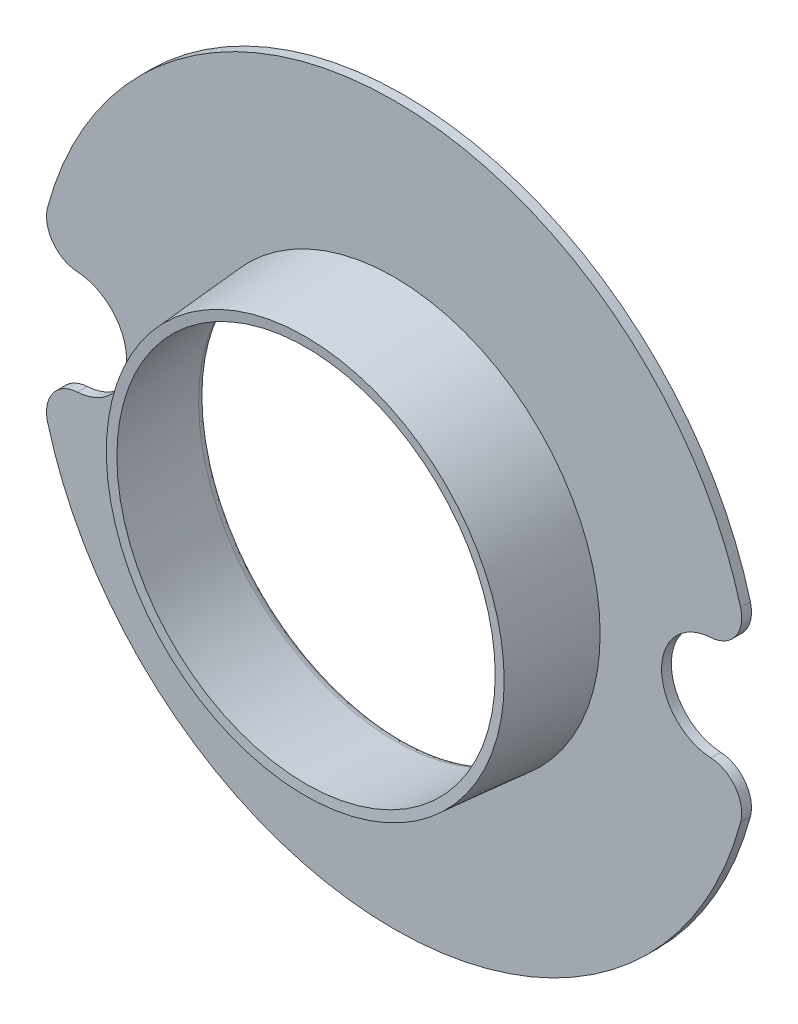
ISO-10303-21;
HEADER;
FILE_DESCRIPTION(('STEP AP214'),'2;1');
FILE_NAME('part.step','',(''),(''),'','','');
FILE_SCHEMA(('AUTOMOTIVE_DESIGN { 1 0 10303 214 1 1 1 1 }'));
ENDSEC;
DATA;
#1=APPLICATION_CONTEXT('core data for automotive mechanical design processes');
#2=APPLICATION_PROTOCOL_DEFINITION('international standard','automotive_design',2000,#1);
#3=PRODUCT_CONTEXT('',#1,'mechanical');
#4=PRODUCT('Part','Part','',(#3));
#5=PRODUCT_RELATED_PRODUCT_CATEGORY('part','',(#4));
#6=PRODUCT_DEFINITION_FORMATION('','',#4);
#7=PRODUCT_DEFINITION_CONTEXT('part definition',#1,'design');
#8=PRODUCT_DEFINITION('design','',#6,#7);
#9=PRODUCT_DEFINITION_SHAPE('','',#8);
#10=(LENGTH_UNIT() NAMED_UNIT(*) SI_UNIT(.MILLI.,.METRE.));
#11=(NAMED_UNIT(*) PLANE_ANGLE_UNIT() SI_UNIT($,.RADIAN.));
#12=(NAMED_UNIT(*) SI_UNIT($,.STERADIAN.) SOLID_ANGLE_UNIT());
#13=UNCERTAINTY_MEASURE_WITH_UNIT(LENGTH_MEASURE(1.E-05),#10,'distance_accuracy_value','');
#14=(GEOMETRIC_REPRESENTATION_CONTEXT(3) GLOBAL_UNCERTAINTY_ASSIGNED_CONTEXT((#13)) GLOBAL_UNIT_ASSIGNED_CONTEXT((#10,
#11,#12)) REPRESENTATION_CONTEXT('',''));
#15=CARTESIAN_POINT('',(0.,0.,0.));
#16=DIRECTION('',(0.,0.,1.));
#17=DIRECTION('',(1.,0.,0.));
#18=AXIS2_PLACEMENT_3D('',#15,#16,#17);
#19=CARTESIAN_POINT('',(0.,0.,22.51196178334));
#20=DIRECTION('',(0.,0.,-1.));
#21=DIRECTION('',(0.,1.,0.));
#22=AXIS2_PLACEMENT_3D('',#19,#20,#21);
#23=CONICAL_SURFACE('',#22,3.04952229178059,0.0798299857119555);
#24=CARTESIAN_POINT('',(0.,0.,22.5119617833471));
#25=DIRECTION('',(0.,0.,-1.));
#26=DIRECTION('',(1.,0.,0.));
#27=AXIS2_PLACEMENT_3D('',#24,#25,#26);
#28=CIRCLE('',#27,3.04952229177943);
#29=CARTESIAN_POINT('',(3.04952229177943,0.,22.5119617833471));
#30=VERTEX_POINT('',#29);
#31=EDGE_CURVE('E96',#30,#30,#28,.T.);
#32=ORIENTED_EDGE('',*,*,#31,.T.);
#33=EDGE_LOOP('',(#32));
#34=FACE_BOUND('',#33,.T.);
#35=CARTESIAN_POINT('',(0.,0.,21.15));
#36=DIRECTION('',(0.,0.,-1.));
#37=DIRECTION('',(0.,1.,0.));
#38=AXIS2_PLACEMENT_3D('',#35,#36,#37);
#39=CIRCLE('',#38,3.15847923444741);
#40=CARTESIAN_POINT('',(0.,3.15847923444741,21.15));
#41=VERTEX_POINT('',#40);
#42=EDGE_CURVE('E95',#41,#41,#39,.F.);
#43=ORIENTED_EDGE('',*,*,#42,.T.);
#44=EDGE_LOOP('',(#43));
#45=FACE_BOUND('',#44,.T.);
#46=ADVANCED_FACE('F16',(#34,#45),#23,.T.);
#47=CARTESIAN_POINT('',(0.,0.,22.5119617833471));
#48=DIRECTION('',(0.,0.,1.));
#49=DIRECTION('',(1.,0.,0.));
#50=AXIS2_PLACEMENT_3D('',#47,#48,#49);
#51=CONICAL_SURFACE('',#50,3.04952229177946,1.49096634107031);
#52=CARTESIAN_POINT('',(0.,0.,22.5));
#53=DIRECTION('',(0.,0.,-1.));
#54=DIRECTION('',(1.,0.,0.));
#55=AXIS2_PLACEMENT_3D('',#52,#53,#54);
#56=CIRCLE('',#55,2.89999999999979);
#57=CARTESIAN_POINT('',(2.89999999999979,0.,22.5));
#58=VERTEX_POINT('',#57);
#59=EDGE_CURVE('E139',#58,#58,#56,.T.);
#60=ORIENTED_EDGE('',*,*,#59,.T.);
#61=EDGE_LOOP('',(#60));
#62=FACE_BOUND('',#61,.T.);
#63=ORIENTED_EDGE('',*,*,#31,.F.);
#64=EDGE_LOOP('',(#63));
#65=FACE_BOUND('',#64,.T.);
#66=ADVANCED_FACE('F190',(#62,#65),#51,.F.);
#67=CARTESIAN_POINT('',(-5.541827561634,5.72,21.15));
#68=DIRECTION('',(0.,0.,-1.));
#69=DIRECTION('',(1.,0.,0.));
#70=AXIS2_PLACEMENT_3D('',#67,#68,#69);
#71=PLANE('',#70);
#72=ORIENTED_EDGE('',*,*,#42,.F.);
#73=EDGE_LOOP('',(#72));
#74=FACE_BOUND('',#73,.T.);
#75=CARTESIAN_POINT('',(4.9,0.,21.15));
#76=DIRECTION('',(0.,0.,1.));
#77=DIRECTION('',(1.,0.,0.));
#78=AXIS2_PLACEMENT_3D('',#75,#76,#77);
#79=CIRCLE('',#78,0.799999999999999);
#80=CARTESIAN_POINT('',(4.85604395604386,-0.798791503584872,21.15));
#81=VERTEX_POINT('',#80);
#82=CARTESIAN_POINT('',(4.85604395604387,0.798791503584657,21.15));
#83=VERTEX_POINT('',#82);
#84=EDGE_CURVE('E99',#81,#83,#79,.F.);
#85=ORIENTED_EDGE('',*,*,#84,.T.);
#86=CARTESIAN_POINT('',(4.828571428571,1.298036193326,21.15));
#87=DIRECTION('',(0.,0.,-1.));
#88=DIRECTION('',(-1.,0.,0.));
#89=AXIS2_PLACEMENT_3D('',#86,#87,#88);
#90=CIRCLE('',#89,0.500000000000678);
#91=CARTESIAN_POINT('',(5.31142857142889,1.42783981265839,21.15));
#92=VERTEX_POINT('',#91);
#93=EDGE_CURVE('E84',#92,#83,#90,.T.);
#94=ORIENTED_EDGE('',*,*,#93,.F.);
#95=CARTESIAN_POINT('',(0.,0.,21.15));
#96=DIRECTION('',(0.,0.,-1.));
#97=DIRECTION('',(-1.,0.,0.));
#98=AXIS2_PLACEMENT_3D('',#95,#96,#97);
#99=CIRCLE('',#98,5.5);
#100=CARTESIAN_POINT('',(-5.31142857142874,1.42783981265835,21.15));
#101=VERTEX_POINT('',#100);
#102=EDGE_CURVE('E142',#92,#101,#99,.F.);
#103=ORIENTED_EDGE('',*,*,#102,.T.);
#104=CARTESIAN_POINT('',(-4.828571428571,1.298036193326,21.15));
#105=DIRECTION('',(0.,0.,1.));
#106=DIRECTION('',(1.,0.,0.));
#107=AXIS2_PLACEMENT_3D('',#104,#105,#106);
#108=CIRCLE('',#107,0.500000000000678);
#109=CARTESIAN_POINT('',(-4.85604395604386,0.798791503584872,21.15));
#110=VERTEX_POINT('',#109);
#111=EDGE_CURVE('E135',#101,#110,#108,.T.);
#112=ORIENTED_EDGE('',*,*,#111,.T.);
#113=CARTESIAN_POINT('',(-4.9,0.,21.15));
#114=DIRECTION('',(0.,0.,-1.));
#115=DIRECTION('',(-1.,0.,0.));
#116=AXIS2_PLACEMENT_3D('',#113,#114,#115);
#117=CIRCLE('',#116,0.799999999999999);
#118=CARTESIAN_POINT('',(-4.85604395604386,-0.798791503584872,21.15));
#119=VERTEX_POINT('',#118);
#120=EDGE_CURVE('E128',#110,#119,#117,.T.);
#121=ORIENTED_EDGE('',*,*,#120,.T.);
#122=CARTESIAN_POINT('',(-4.828571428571,-1.298036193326,21.15));
#123=DIRECTION('',(0.,0.,-1.));
#124=DIRECTION('',(-1.,0.,0.));
#125=AXIS2_PLACEMENT_3D('',#122,#123,#124);
#126=CIRCLE('',#125,0.500000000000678);
#127=CARTESIAN_POINT('',(-5.31142857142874,-1.42783981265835,21.15));
#128=VERTEX_POINT('',#127);
#129=EDGE_CURVE('E127',#119,#128,#126,.F.);
#130=ORIENTED_EDGE('',*,*,#129,.T.);
#131=CARTESIAN_POINT('',(0.,0.,21.15));
#132=DIRECTION('',(0.,0.,-1.));
#133=DIRECTION('',(-1.,0.,0.));
#134=AXIS2_PLACEMENT_3D('',#131,#132,#133);
#135=CIRCLE('',#134,5.5);
#136=CARTESIAN_POINT('',(5.31142857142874,-1.42783981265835,21.15));
#137=VERTEX_POINT('',#136);
#138=EDGE_CURVE('E123',#128,#137,#135,.F.);
#139=ORIENTED_EDGE('',*,*,#138,.T.);
#140=CARTESIAN_POINT('',(4.828571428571,-1.298036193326,21.15));
#141=DIRECTION('',(0.,0.,1.));
#142=DIRECTION('',(1.,0.,0.));
#143=AXIS2_PLACEMENT_3D('',#140,#141,#142);
#144=CIRCLE('',#143,0.500000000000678);
#145=EDGE_CURVE('E102',#137,#81,#144,.T.);
#146=ORIENTED_EDGE('',*,*,#145,.T.);
#147=EDGE_LOOP('',(#85,#94,#103,#112,#121,#130,#139,#146));
#148=FACE_BOUND('',#147,.T.);
#149=ADVANCED_FACE('F100',(#74,#148),#71,.F.);
#150=CARTESIAN_POINT('',(0.,0.,22.5));
#151=DIRECTION('',(0.,0.,-1.));
#152=DIRECTION('',(-1.,0.,0.));
#153=AXIS2_PLACEMENT_3D('',#150,#151,#152);
#154=CONICAL_SURFACE('',#153,2.89999999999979,0.0798299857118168);
#155=ORIENTED_EDGE('',*,*,#59,.F.);
#156=EDGE_LOOP('',(#155));
#157=FACE_BOUND('',#156,.T.);
#158=CARTESIAN_POINT('',(0.,0.,21.13803822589));
#159=DIRECTION('',(0.,0.,-1.));
#160=DIRECTION('',(-0.999963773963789,-0.00851180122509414,0.));
#161=AXIS2_PLACEMENT_3D('',#158,#159,#160);
#162=CIRCLE('',#161,3.0089569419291);
#163=CARTESIAN_POINT('',(-3.00884793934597,-0.0256116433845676,21.13803822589));
#164=VERTEX_POINT('',#163);
#165=EDGE_CURVE('E112',#164,#164,#162,.T.);
#166=ORIENTED_EDGE('',*,*,#165,.T.);
#167=EDGE_LOOP('',(#166));
#168=FACE_BOUND('',#167,.T.);
#169=ADVANCED_FACE('F189',(#157,#168),#154,.F.);
#170=CARTESIAN_POINT('',(0.,0.,21.15));
#171=DIRECTION('',(0.,0.,-1.));
#172=DIRECTION('',(-1.,0.,0.));
#173=AXIS2_PLACEMENT_3D('',#170,#171,#172);
#174=CYLINDRICAL_SURFACE('',#173,5.5);
#175=CARTESIAN_POINT('',(0.,0.,21.));
#176=DIRECTION('',(0.,0.,-1.));
#177=DIRECTION('',(-1.,0.,0.));
#178=AXIS2_PLACEMENT_3D('',#175,#176,#177);
#179=CIRCLE('',#178,5.5);
#180=CARTESIAN_POINT('',(5.31142857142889,1.42783981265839,21.));
#181=VERTEX_POINT('',#180);
#182=CARTESIAN_POINT('',(-5.31142857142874,1.42783981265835,21.));
#183=VERTEX_POINT('',#182);
#184=EDGE_CURVE('E138',#181,#183,#179,.F.);
#185=ORIENTED_EDGE('',*,*,#184,.T.);
#186=DIRECTION('',(0.,0.,1.));
#187=VECTOR('',#186,1.);
#188=CARTESIAN_POINT('',(-5.311428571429,1.427839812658,21.075));
#189=LINE('',#188,#187);
#190=EDGE_CURVE('E132',#183,#101,#189,.T.);
#191=ORIENTED_EDGE('',*,*,#190,.T.);
#192=ORIENTED_EDGE('',*,*,#102,.F.);
#193=DIRECTION('',(0.,0.,-1.));
#194=VECTOR('',#193,1.);
#195=CARTESIAN_POINT('',(5.311428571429,1.427839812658,21.075));
#196=LINE('',#195,#194);
#197=EDGE_CURVE('E94',#92,#181,#196,.T.);
#198=ORIENTED_EDGE('',*,*,#197,.T.);
#199=EDGE_LOOP('',(#185,#191,#192,#198));
#200=FACE_BOUND('',#199,.T.);
#201=ADVANCED_FACE('F196',(#200),#174,.T.);
#202=CARTESIAN_POINT('',(-4.828571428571,1.298036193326,21.));
#203=DIRECTION('',(0.,0.,1.));
#204=DIRECTION('',(1.,0.,0.));
#205=AXIS2_PLACEMENT_3D('',#202,#203,#204);
#206=CYLINDRICAL_SURFACE('',#205,0.500000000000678);
#207=CARTESIAN_POINT('',(-4.828571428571,1.298036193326,21.));
#208=DIRECTION('',(0.,0.,1.));
#209=DIRECTION('',(1.,0.,0.));
#210=AXIS2_PLACEMENT_3D('',#207,#208,#209);
#211=CIRCLE('',#210,0.500000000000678);
#212=CARTESIAN_POINT('',(-4.85604395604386,0.798791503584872,21.));
#213=VERTEX_POINT('',#212);
#214=EDGE_CURVE('E175',#183,#213,#211,.T.);
#215=ORIENTED_EDGE('',*,*,#214,.T.);
#216=DIRECTION('',(0.,0.,-1.));
#217=VECTOR('',#216,1.);
#218=CARTESIAN_POINT('',(-4.856043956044,0.798791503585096,21.075));
#219=LINE('',#218,#217);
#220=EDGE_CURVE('E129',#213,#110,#219,.F.);
#221=ORIENTED_EDGE('',*,*,#220,.T.);
#222=ORIENTED_EDGE('',*,*,#111,.F.);
#223=ORIENTED_EDGE('',*,*,#190,.F.);
#224=EDGE_LOOP('',(#215,#221,#222,#223));
#225=FACE_BOUND('',#224,.T.);
#226=ADVANCED_FACE('F217',(#225),#206,.T.);
#227=CARTESIAN_POINT('',(-4.9,0.,21.15));
#228=DIRECTION('',(0.,0.,-1.));
#229=DIRECTION('',(-1.,0.,0.));
#230=AXIS2_PLACEMENT_3D('',#227,#228,#229);
#231=CYLINDRICAL_SURFACE('',#230,0.799999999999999);
#232=DIRECTION('',(0.,0.,1.));
#233=VECTOR('',#232,1.);
#234=CARTESIAN_POINT('',(-4.85604395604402,-0.798791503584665,21.075));
#235=LINE('',#234,#233);
#236=CARTESIAN_POINT('',(-4.85604395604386,-0.798791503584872,21.));
#237=VERTEX_POINT('',#236);
#238=EDGE_CURVE('E124',#237,#119,#235,.T.);
#239=ORIENTED_EDGE('',*,*,#238,.T.);
#240=ORIENTED_EDGE('',*,*,#120,.F.);
#241=ORIENTED_EDGE('',*,*,#220,.F.);
#242=CARTESIAN_POINT('',(-4.9,0.,21.));
#243=DIRECTION('',(0.,0.,-1.));
#244=DIRECTION('',(-1.,0.,0.));
#245=AXIS2_PLACEMENT_3D('',#242,#243,#244);
#246=CIRCLE('',#245,0.799999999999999);
#247=EDGE_CURVE('E173',#213,#237,#246,.T.);
#248=ORIENTED_EDGE('',*,*,#247,.T.);
#249=EDGE_LOOP('',(#239,#240,#241,#248));
#250=FACE_BOUND('',#249,.T.);
#251=ADVANCED_FACE('F223',(#250),#231,.F.);
#252=CARTESIAN_POINT('',(-4.828571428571,-1.298036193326,21.15));
#253=DIRECTION('',(0.,0.,-1.));
#254=DIRECTION('',(-1.,0.,0.));
#255=AXIS2_PLACEMENT_3D('',#252,#253,#254);
#256=CYLINDRICAL_SURFACE('',#255,0.500000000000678);
#257=ORIENTED_EDGE('',*,*,#129,.F.);
#258=ORIENTED_EDGE('',*,*,#238,.F.);
#259=CARTESIAN_POINT('',(-4.828571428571,-1.298036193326,21.));
#260=DIRECTION('',(0.,0.,-1.));
#261=DIRECTION('',(-1.,0.,0.));
#262=AXIS2_PLACEMENT_3D('',#259,#260,#261);
#263=CIRCLE('',#262,0.500000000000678);
#264=CARTESIAN_POINT('',(-5.31142857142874,-1.42783981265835,21.));
#265=VERTEX_POINT('',#264);
#266=EDGE_CURVE('E171',#237,#265,#263,.F.);
#267=ORIENTED_EDGE('',*,*,#266,.T.);
#268=DIRECTION('',(0.,0.,1.));
#269=VECTOR('',#268,1.);
#270=CARTESIAN_POINT('',(-5.31142857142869,-1.42783981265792,21.075));
#271=LINE('',#270,#269);
#272=EDGE_CURVE('E120',#265,#128,#271,.T.);
#273=ORIENTED_EDGE('',*,*,#272,.T.);
#274=EDGE_LOOP('',(#257,#258,#267,#273));
#275=FACE_BOUND('',#274,.T.);
#276=ADVANCED_FACE('F226',(#275),#256,.T.);
#277=CARTESIAN_POINT('',(0.,0.,21.15));
#278=DIRECTION('',(0.,0.,-1.));
#279=DIRECTION('',(-1.,0.,0.));
#280=AXIS2_PLACEMENT_3D('',#277,#278,#279);
#281=CYLINDRICAL_SURFACE('',#280,5.5);
#282=CARTESIAN_POINT('',(0.,0.,21.));
#283=DIRECTION('',(0.,0.,-1.));
#284=DIRECTION('',(-1.,0.,0.));
#285=AXIS2_PLACEMENT_3D('',#282,#283,#284);
#286=CIRCLE('',#285,5.5);
#287=CARTESIAN_POINT('',(5.31142857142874,-1.42783981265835,21.));
#288=VERTEX_POINT('',#287);
#289=EDGE_CURVE('E169',#265,#288,#286,.F.);
#290=ORIENTED_EDGE('',*,*,#289,.T.);
#291=DIRECTION('',(0.,0.,1.));
#292=VECTOR('',#291,1.);
#293=CARTESIAN_POINT('',(5.311428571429,-1.427839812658,21.075));
#294=LINE('',#293,#292);
#295=EDGE_CURVE('E117',#288,#137,#294,.T.);
#296=ORIENTED_EDGE('',*,*,#295,.T.);
#297=ORIENTED_EDGE('',*,*,#138,.F.);
#298=ORIENTED_EDGE('',*,*,#272,.F.);
#299=EDGE_LOOP('',(#290,#296,#297,#298));
#300=FACE_BOUND('',#299,.T.);
#301=ADVANCED_FACE('F230',(#300),#281,.T.);
#302=CARTESIAN_POINT('',(4.828571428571,-1.298036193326,21.));
#303=DIRECTION('',(0.,0.,1.));
#304=DIRECTION('',(1.,0.,0.));
#305=AXIS2_PLACEMENT_3D('',#302,#303,#304);
#306=CYLINDRICAL_SURFACE('',#305,0.500000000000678);
#307=CARTESIAN_POINT('',(4.828571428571,-1.298036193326,21.));
#308=DIRECTION('',(0.,0.,1.));
#309=DIRECTION('',(1.,0.,0.));
#310=AXIS2_PLACEMENT_3D('',#307,#308,#309);
#311=CIRCLE('',#310,0.500000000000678);
#312=CARTESIAN_POINT('',(4.85604395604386,-0.798791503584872,21.));
#313=VERTEX_POINT('',#312);
#314=EDGE_CURVE('E167',#288,#313,#311,.T.);
#315=ORIENTED_EDGE('',*,*,#314,.T.);
#316=DIRECTION('',(0.,0.,-1.));
#317=VECTOR('',#316,1.);
#318=CARTESIAN_POINT('',(4.856043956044,-0.798791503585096,21.075));
#319=LINE('',#318,#317);
#320=EDGE_CURVE('E106',#313,#81,#319,.F.);
#321=ORIENTED_EDGE('',*,*,#320,.T.);
#322=ORIENTED_EDGE('',*,*,#145,.F.);
#323=ORIENTED_EDGE('',*,*,#295,.F.);
#324=EDGE_LOOP('',(#315,#321,#322,#323));
#325=FACE_BOUND('',#324,.T.);
#326=ADVANCED_FACE('F233',(#325),#306,.T.);
#327=CARTESIAN_POINT('',(4.9,0.,21.));
#328=DIRECTION('',(0.,0.,1.));
#329=DIRECTION('',(1.,0.,0.));
#330=AXIS2_PLACEMENT_3D('',#327,#328,#329);
#331=CYLINDRICAL_SURFACE('',#330,0.799999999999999);
#332=ORIENTED_EDGE('',*,*,#320,.F.);
#333=CARTESIAN_POINT('',(4.9,0.,21.));
#334=DIRECTION('',(0.,0.,1.));
#335=DIRECTION('',(1.,0.,0.));
#336=AXIS2_PLACEMENT_3D('',#333,#334,#335);
#337=CIRCLE('',#336,0.799999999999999);
#338=CARTESIAN_POINT('',(4.85604395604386,0.798791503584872,21.));
#339=VERTEX_POINT('',#338);
#340=EDGE_CURVE('E110',#313,#339,#337,.F.);
#341=ORIENTED_EDGE('',*,*,#340,.T.);
#342=DIRECTION('',(0.,0.,1.));
#343=VECTOR('',#342,1.);
#344=CARTESIAN_POINT('',(4.85604395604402,0.798791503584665,21.075));
#345=LINE('',#344,#343);
#346=EDGE_CURVE('E92',#339,#83,#345,.T.);
#347=ORIENTED_EDGE('',*,*,#346,.T.);
#348=ORIENTED_EDGE('',*,*,#84,.F.);
#349=EDGE_LOOP('',(#332,#341,#347,#348));
#350=FACE_BOUND('',#349,.T.);
#351=ADVANCED_FACE('F108',(#350),#331,.F.);
#352=CARTESIAN_POINT('',(4.828571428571,1.298036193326,21.15));
#353=DIRECTION('',(0.,0.,-1.));
#354=DIRECTION('',(-1.,0.,0.));
#355=AXIS2_PLACEMENT_3D('',#352,#353,#354);
#356=CYLINDRICAL_SURFACE('',#355,0.500000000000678);
#357=ORIENTED_EDGE('',*,*,#93,.T.);
#358=ORIENTED_EDGE('',*,*,#346,.F.);
#359=CARTESIAN_POINT('',(4.828571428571,1.298036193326,21.));
#360=DIRECTION('',(0.,0.,-1.));
#361=DIRECTION('',(-1.,0.,0.));
#362=AXIS2_PLACEMENT_3D('',#359,#360,#361);
#363=CIRCLE('',#362,0.500000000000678);
#364=EDGE_CURVE('E159',#339,#181,#363,.F.);
#365=ORIENTED_EDGE('',*,*,#364,.T.);
#366=ORIENTED_EDGE('',*,*,#197,.F.);
#367=EDGE_LOOP('',(#357,#358,#365,#366));
#368=FACE_BOUND('',#367,.T.);
#369=ADVANCED_FACE('F89',(#368),#356,.T.);
#370=CARTESIAN_POINT('',(-3.17707368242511,-0.0270435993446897,21.0011713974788));
#371=CARTESIAN_POINT('',(-3.07763276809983,-0.0261971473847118,20.9886700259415));
#372=CARTESIAN_POINT('',(-3.00399245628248,-0.0255703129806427,21.0566568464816));
#373=CARTESIAN_POINT('',(-3.00852362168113,-0.0256088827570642,21.156781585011));
#374=(BOUNDED_CURVE() B_SPLINE_CURVE(3,(#370,#371,#372,#373),.UNSPECIFIED.,.F.,
.F.) B_SPLINE_CURVE_WITH_KNOTS((4,4),(0.,1.),
.UNSPECIFIED.) CURVE() GEOMETRIC_REPRESENTATION_ITEM() RATIONAL_B_SPLINE_CURVE((1.,
0.76294290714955,0.76294290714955,1.)) REPRESENTATION_ITEM(''));
#375=CARTESIAN_POINT('',(0.,0.,21.15));
#376=DIRECTION('',(0.,0.,-1.));
#377=AXIS1_PLACEMENT('',#375,#376);
#378=SURFACE_OF_REVOLUTION('',#374,#377);
#379=CARTESIAN_POINT('',(0.,0.,21.));
#380=DIRECTION('',(0.,0.,-1.));
#381=DIRECTION('',(-1.,-1.90835086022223E-13,0.));
#382=AXIS2_PLACEMENT_3D('',#379,#380,#381);
#383=CIRCLE('',#382,3.15847917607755);
#384=CARTESIAN_POINT('',(-3.15847915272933,-3.62206756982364E-13,21.));
#385=VERTEX_POINT('',#384);
#386=CARTESIAN_POINT('',(3.15847915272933,3.61909890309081E-13,21.));
#387=VERTEX_POINT('',#386);
#388=EDGE_CURVE('E11',#385,#387,#383,.T.);
#389=ORIENTED_EDGE('',*,*,#388,.T.);
#390=CARTESIAN_POINT('',(0.,0.,21.));
#391=DIRECTION('',(0.,0.,-1.));
#392=DIRECTION('',(1.,1.90829722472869E-13,0.));
#393=AXIS2_PLACEMENT_3D('',#390,#391,#392);
#394=CIRCLE('',#393,3.15847917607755);
#395=EDGE_CURVE('E29',#387,#385,#394,.T.);
#396=ORIENTED_EDGE('',*,*,#395,.T.);
#397=EDGE_LOOP('',(#389,#396));
#398=FACE_BOUND('',#397,.T.);
#399=ORIENTED_EDGE('',*,*,#165,.F.);
#400=EDGE_LOOP('',(#399));
#401=FACE_BOUND('',#400,.T.);
#402=ADVANCED_FACE('F203',(#398,#401),#378,.T.);
#403=CARTESIAN_POINT('',(-5.541827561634,5.72,21.));
#404=DIRECTION('',(0.,0.,-1.));
#405=DIRECTION('',(1.,0.,0.));
#406=AXIS2_PLACEMENT_3D('',#403,#404,#405);
#407=PLANE('',#406);
#408=ORIENTED_EDGE('',*,*,#395,.F.);
#409=ORIENTED_EDGE('',*,*,#388,.F.);
#410=EDGE_LOOP('',(#408,#409));
#411=FACE_BOUND('',#410,.T.);
#412=ORIENTED_EDGE('',*,*,#340,.F.);
#413=ORIENTED_EDGE('',*,*,#314,.F.);
#414=ORIENTED_EDGE('',*,*,#289,.F.);
#415=ORIENTED_EDGE('',*,*,#266,.F.);
#416=ORIENTED_EDGE('',*,*,#247,.F.);
#417=ORIENTED_EDGE('',*,*,#214,.F.);
#418=ORIENTED_EDGE('',*,*,#184,.F.);
#419=ORIENTED_EDGE('',*,*,#364,.F.);
#420=EDGE_LOOP('',(#412,#413,#414,#415,#416,#417,#418,#419));
#421=FACE_BOUND('',#420,.T.);
#422=ADVANCED_FACE('F18',(#411,#421),#407,.T.);
#423=CLOSED_SHELL('',(#46,#66,#149,#169,#201,#226,#251,#276,#301,#326,#351,#369,#402,#422));
#424=MANIFOLD_SOLID_BREP('B1',#423);
#425=ADVANCED_BREP_SHAPE_REPRESENTATION('',(#18,#424),#14);
#426=SHAPE_DEFINITION_REPRESENTATION(#9,#425);
ENDSEC;
END-ISO-10303-21;
